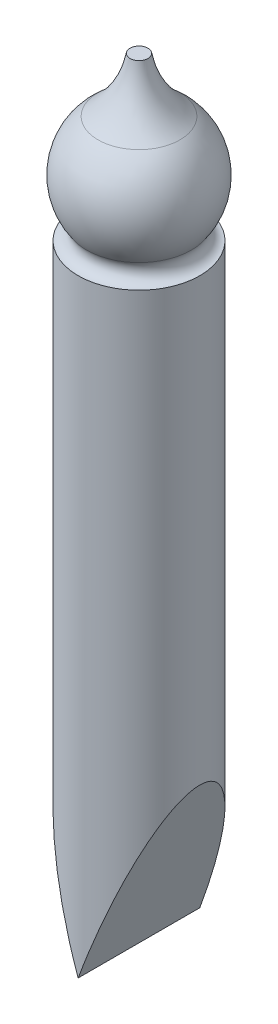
from build123d import *

# Parameters (mm, degrees)
SKETCH1_R           = 3
BOSS_EXTRUDE1_DEPTH = 30
CUT_EXTRUDE3_DEPTH  = 15


with BuildPart() as part:
    # Sketch1 → Boss-Extrude1 (new body)
    with BuildSketch(Plane(origin=(0, 0, 0), x_dir=(1, 0, 0), z_dir=(0, 1, 0))):
        with Locations(Location((0, 0, 0), (0, 0, 270))):
            Circle(SKETCH1_R)
    extrude(amount=BOSS_EXTRUDE1_DEPTH)

    # Sketch2 → Revolve1 (revolve)
    with BuildSketch(Plane.XY):
        with BuildLine():
            Line((0, 30), (0, 38))
            Line((0, 38), (0.441311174, 38))
            ThreePointArc((0.441311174, 38), (0.984174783, 36.511034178), (2.019326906, 35.310959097))
            ThreePointArc((2.019326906, 35.310959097), (3.193223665, 33.213813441), (2.587654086, 30.888014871))
            ThreePointArc((2.587654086, 30.888014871), (2.530100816, 30.321547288), (3, 30))
            Line((3, 30), (0, 30))
        make_face()
    revolve(axis=Axis((0, 30, 0), (0, 1, 0)))

    # Sketch3 → Cut-Extrude3 (cut, symmetric)
    with BuildSketch(Plane.XY):
        Polygon((-3, 0), (0, 0), (-3, 8.242432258), align=None)
        Polygon((3, 8.242432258), (0, 0), (3, 0), align=None)
    extrude(amount=CUT_EXTRUDE3_DEPTH, both=True, mode=Mode.SUBTRACT)


solid = part.part
